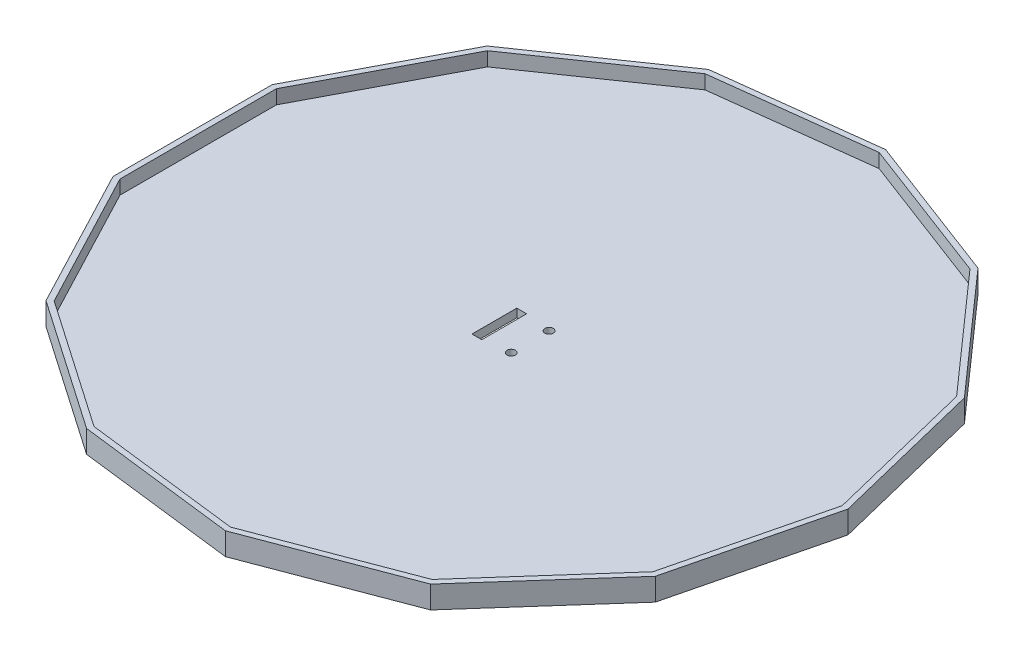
ISO-10303-21;
HEADER;
FILE_DESCRIPTION(('STEP AP214'),'2;1');
FILE_NAME('part.step','',(''),(''),'','','');
FILE_SCHEMA(('AUTOMOTIVE_DESIGN { 1 0 10303 214 1 1 1 1 }'));
ENDSEC;
DATA;
#1=APPLICATION_CONTEXT('core data for automotive mechanical design processes');
#2=APPLICATION_PROTOCOL_DEFINITION('international standard','automotive_design',2000,#1);
#3=PRODUCT_CONTEXT('',#1,'mechanical');
#4=PRODUCT('Part','Part','',(#3));
#5=PRODUCT_RELATED_PRODUCT_CATEGORY('part','',(#4));
#6=PRODUCT_DEFINITION_FORMATION('','',#4);
#7=PRODUCT_DEFINITION_CONTEXT('part definition',#1,'design');
#8=PRODUCT_DEFINITION('design','',#6,#7);
#9=PRODUCT_DEFINITION_SHAPE('','',#8);
#10=(LENGTH_UNIT() NAMED_UNIT(*) SI_UNIT(.MILLI.,.METRE.));
#11=(NAMED_UNIT(*) PLANE_ANGLE_UNIT() SI_UNIT($,.RADIAN.));
#12=(NAMED_UNIT(*) SI_UNIT($,.STERADIAN.) SOLID_ANGLE_UNIT());
#13=UNCERTAINTY_MEASURE_WITH_UNIT(LENGTH_MEASURE(1.E-05),#10,'distance_accuracy_value','');
#14=(GEOMETRIC_REPRESENTATION_CONTEXT(3) GLOBAL_UNCERTAINTY_ASSIGNED_CONTEXT((#13)) GLOBAL_UNIT_ASSIGNED_CONTEXT((#10,
#11,#12)) REPRESENTATION_CONTEXT('',''));
#15=CARTESIAN_POINT('',(0.,0.,0.));
#16=DIRECTION('',(0.,0.,1.));
#17=DIRECTION('',(1.,0.,0.));
#18=AXIS2_PLACEMENT_3D('',#15,#16,#17);
#19=CARTESIAN_POINT('',(0.,8.,0.));
#20=DIRECTION('',(0.,1.,0.));
#21=DIRECTION('',(0.,0.,1.));
#22=AXIS2_PLACEMENT_3D('',#19,#20,#21);
#23=PLANE('',#22);
#24=DIRECTION('',(-0.822983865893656,0.,0.568064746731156));
#25=VECTOR('',#24,1.);
#26=CARTESIAN_POINT('',(-42.0528725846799,8.,-110.884311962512));
#27=LINE('',#26,#25);
#28=CARTESIAN_POINT('',(-42.0528725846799,8.,-110.884311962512));
#29=VERTEX_POINT('',#28);
#30=CARTESIAN_POINT('',(-88.7664786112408,8.,-78.6402378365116));
#31=VERTEX_POINT('',#30);
#32=EDGE_CURVE('E422',#29,#31,#27,.T.);
#33=ORIENTED_EDGE('',*,*,#32,.T.);
#34=DIRECTION('',(-0.464723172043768,0.,0.88545602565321));
#35=VECTOR('',#34,1.);
#36=CARTESIAN_POINT('',(-88.7664786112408,8.,-78.6402378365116));
#37=LINE('',#36,#35);
#38=CARTESIAN_POINT('',(-115.14475414,8.,-28.3806329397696));
#39=VERTEX_POINT('',#38);
#40=EDGE_CURVE('E426',#31,#39,#37,.T.);
#41=ORIENTED_EDGE('',*,*,#40,.T.);
#42=DIRECTION('',(0.,0.,1.));
#43=VECTOR('',#42,1.);
#44=CARTESIAN_POINT('',(-115.14475414,8.,-28.3806329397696));
#45=LINE('',#44,#43);
#46=CARTESIAN_POINT('',(-115.14475414,8.,28.3806329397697));
#47=VERTEX_POINT('',#46);
#48=EDGE_CURVE('E430',#39,#47,#45,.T.);
#49=ORIENTED_EDGE('',*,*,#48,.T.);
#50=DIRECTION('',(0.464723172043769,0.,0.88545602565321));
#51=VECTOR('',#50,1.);
#52=CARTESIAN_POINT('',(-115.14475414,8.,28.3806329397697));
#53=LINE('',#52,#51);
#54=CARTESIAN_POINT('',(-88.7664786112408,8.,78.6402378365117));
#55=VERTEX_POINT('',#54);
#56=EDGE_CURVE('E433',#47,#55,#53,.T.);
#57=ORIENTED_EDGE('',*,*,#56,.T.);
#58=DIRECTION('',(0.822983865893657,0.,0.568064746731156));
#59=VECTOR('',#58,1.);
#60=CARTESIAN_POINT('',(-88.7664786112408,8.,78.6402378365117));
#61=LINE('',#60,#59);
#62=CARTESIAN_POINT('',(-42.0528725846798,8.,110.884311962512));
#63=VERTEX_POINT('',#62);
#64=EDGE_CURVE('E436',#55,#63,#61,.T.);
#65=ORIENTED_EDGE('',*,*,#64,.T.);
#66=DIRECTION('',(0.992708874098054,0.,0.120536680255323));
#67=VECTOR('',#66,1.);
#68=CARTESIAN_POINT('',(-42.0528725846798,8.,110.884311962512));
#69=LINE('',#68,#67);
#70=CARTESIAN_POINT('',(14.2945397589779,8.,117.726126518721));
#71=VERTEX_POINT('',#70);
#72=EDGE_CURVE('E439',#63,#71,#69,.T.);
#73=ORIENTED_EDGE('',*,*,#72,.T.);
#74=DIRECTION('',(0.935016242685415,0.,-0.354604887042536));
#75=VECTOR('',#74,1.);
#76=CARTESIAN_POINT('',(14.2945397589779,8.,117.726126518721));
#77=LINE('',#76,#75);
#78=CARTESIAN_POINT('',(67.3672453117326,8.,97.598304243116));
#79=VERTEX_POINT('',#78);
#80=EDGE_CURVE('E442',#71,#79,#77,.T.);
#81=ORIENTED_EDGE('',*,*,#80,.T.);
#82=DIRECTION('',(0.663122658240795,0.,-0.748510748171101));
#83=VECTOR('',#82,1.);
#84=CARTESIAN_POINT('',(67.3672453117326,8.,97.598304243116));
#85=LINE('',#84,#83);
#86=CARTESIAN_POINT('',(105.006926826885,8.,55.1118866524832));
#87=VERTEX_POINT('',#86);
#88=EDGE_CURVE('E445',#79,#87,#85,.T.);
#89=ORIENTED_EDGE('',*,*,#88,.T.);
#90=DIRECTION('',(0.239315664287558,0.,-0.970941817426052));
#91=VECTOR('',#90,1.);
#92=CARTESIAN_POINT('',(105.006926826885,8.,55.1118866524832));
#93=LINE('',#92,#91);
#94=CARTESIAN_POINT('',(118.59078687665,8.,0.));
#95=VERTEX_POINT('',#94);
#96=EDGE_CURVE('E448',#87,#95,#93,.T.);
#97=ORIENTED_EDGE('',*,*,#96,.T.);
#98=DIRECTION('',(-0.239315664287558,0.,-0.970941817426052));
#99=VECTOR('',#98,1.);
#100=CARTESIAN_POINT('',(118.59078687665,8.,0.));
#101=LINE('',#100,#99);
#102=CARTESIAN_POINT('',(105.006926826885,8.,-55.1118866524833));
#103=VERTEX_POINT('',#102);
#104=EDGE_CURVE('E451',#95,#103,#101,.T.);
#105=ORIENTED_EDGE('',*,*,#104,.T.);
#106=DIRECTION('',(-0.663122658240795,0.,-0.748510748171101));
#107=VECTOR('',#106,1.);
#108=CARTESIAN_POINT('',(105.006926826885,8.,-55.1118866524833));
#109=LINE('',#108,#107);
#110=CARTESIAN_POINT('',(67.3672453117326,8.,-97.598304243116));
#111=VERTEX_POINT('',#110);
#112=EDGE_CURVE('E454',#103,#111,#109,.T.);
#113=ORIENTED_EDGE('',*,*,#112,.T.);
#114=DIRECTION('',(-0.935016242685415,0.,-0.354604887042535));
#115=VECTOR('',#114,1.);
#116=CARTESIAN_POINT('',(67.3672453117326,8.,-97.598304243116));
#117=LINE('',#116,#115);
#118=CARTESIAN_POINT('',(14.2945397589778,8.,-117.726126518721));
#119=VERTEX_POINT('',#118);
#120=EDGE_CURVE('E457',#111,#119,#117,.T.);
#121=ORIENTED_EDGE('',*,*,#120,.T.);
#122=DIRECTION('',(-0.992708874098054,0.,0.120536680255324));
#123=VECTOR('',#122,1.);
#124=CARTESIAN_POINT('',(14.2945397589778,8.,-117.726126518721));
#125=LINE('',#124,#123);
#126=EDGE_CURVE('E460',#119,#29,#125,.T.);
#127=ORIENTED_EDGE('',*,*,#126,.T.);
#128=EDGE_LOOP('',(#33,#41,#49,#57,#65,#73,#81,#89,#97,#105,#113,#121,#127));
#129=FACE_BOUND('',#128,.T.);
#130=DIRECTION('',(-0.239315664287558,0.,-0.970941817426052));
#131=VECTOR('',#130,1.);
#132=CARTESIAN_POINT('',(116.53093121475,8.,0.));
#133=LINE('',#132,#131);
#134=CARTESIAN_POINT('',(116.53093121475,8.,0.));
#135=VERTEX_POINT('',#134);
#136=CARTESIAN_POINT('',(103.18301521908,8.,-54.154623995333));
#137=VERTEX_POINT('',#136);
#138=EDGE_CURVE('E333',#135,#137,#133,.T.);
#139=ORIENTED_EDGE('',*,*,#138,.F.);
#140=DIRECTION('',(0.239315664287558,0.,-0.970941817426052));
#141=VECTOR('',#140,1.);
#142=CARTESIAN_POINT('',(103.183015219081,8.,54.154623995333));
#143=LINE('',#142,#141);
#144=CARTESIAN_POINT('',(103.183015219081,8.,54.154623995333));
#145=VERTEX_POINT('',#144);
#146=EDGE_CURVE('E330',#145,#135,#143,.T.);
#147=ORIENTED_EDGE('',*,*,#146,.F.);
#148=DIRECTION('',(0.663122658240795,0.,-0.748510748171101));
#149=VECTOR('',#148,1.);
#150=CARTESIAN_POINT('',(66.197113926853,8.,95.903076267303));
#151=LINE('',#150,#149);
#152=CARTESIAN_POINT('',(66.1971139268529,8.,95.903076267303));
#153=VERTEX_POINT('',#152);
#154=EDGE_CURVE('E367',#153,#145,#151,.T.);
#155=ORIENTED_EDGE('',*,*,#154,.F.);
#156=DIRECTION('',(0.935016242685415,0.,-0.354604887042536));
#157=VECTOR('',#156,1.);
#158=CARTESIAN_POINT('',(14.0462515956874,8.,115.681289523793));
#159=LINE('',#158,#157);
#160=CARTESIAN_POINT('',(14.0462515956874,8.,115.681289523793));
#161=VERTEX_POINT('',#160);
#162=EDGE_CURVE('E363',#161,#153,#159,.T.);
#163=ORIENTED_EDGE('',*,*,#162,.F.);
#164=DIRECTION('',(0.992708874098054,0.,0.120536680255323));
#165=VECTOR('',#164,1.);
#166=CARTESIAN_POINT('',(-41.322437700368,8.,108.958313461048));
#167=LINE('',#166,#165);
#168=CARTESIAN_POINT('',(-41.322437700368,8.,108.958313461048));
#169=VERTEX_POINT('',#168);
#170=EDGE_CURVE('E360',#169,#161,#167,.T.);
#171=ORIENTED_EDGE('',*,*,#170,.F.);
#172=DIRECTION('',(0.822983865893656,0.,0.568064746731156));
#173=VECTOR('',#172,1.);
#174=CARTESIAN_POINT('',(-87.224654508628,8.,77.2743008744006));
#175=LINE('',#174,#173);
#176=CARTESIAN_POINT('',(-87.224654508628,8.,77.2743008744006));
#177=VERTEX_POINT('',#176);
#178=EDGE_CURVE('E357',#177,#169,#175,.T.);
#179=ORIENTED_EDGE('',*,*,#178,.F.);
#180=DIRECTION('',(0.464723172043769,0.,0.88545602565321));
#181=VECTOR('',#180,1.);
#182=CARTESIAN_POINT('',(-113.14475414,8.,27.8876772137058));
#183=LINE('',#182,#181);
#184=CARTESIAN_POINT('',(-113.14475414,8.,27.8876772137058));
#185=VERTEX_POINT('',#184);
#186=EDGE_CURVE('E354',#185,#177,#183,.T.);
#187=ORIENTED_EDGE('',*,*,#186,.F.);
#188=DIRECTION('',(0.,0.,1.));
#189=VECTOR('',#188,1.);
#190=CARTESIAN_POINT('',(-113.14475414,8.,-27.8876772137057));
#191=LINE('',#190,#189);
#192=CARTESIAN_POINT('',(-113.14475414,8.,-27.8876772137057));
#193=VERTEX_POINT('',#192);
#194=EDGE_CURVE('E351',#193,#185,#191,.T.);
#195=ORIENTED_EDGE('',*,*,#194,.F.);
#196=DIRECTION('',(-0.464723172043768,0.,0.88545602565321));
#197=VECTOR('',#196,1.);
#198=CARTESIAN_POINT('',(-87.224654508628,8.,-77.2743008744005));
#199=LINE('',#198,#197);
#200=CARTESIAN_POINT('',(-87.224654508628,8.,-77.2743008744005));
#201=VERTEX_POINT('',#200);
#202=EDGE_CURVE('E348',#201,#193,#199,.T.);
#203=ORIENTED_EDGE('',*,*,#202,.F.);
#204=DIRECTION('',(-0.822983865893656,0.,0.568064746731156));
#205=VECTOR('',#204,1.);
#206=CARTESIAN_POINT('',(-41.3224377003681,8.,-108.958313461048));
#207=LINE('',#206,#205);
#208=CARTESIAN_POINT('',(-41.3224377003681,8.,-108.958313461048));
#209=VERTEX_POINT('',#208);
#210=EDGE_CURVE('E345',#209,#201,#207,.T.);
#211=ORIENTED_EDGE('',*,*,#210,.F.);
#212=DIRECTION('',(-0.992708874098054,0.,0.120536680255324));
#213=VECTOR('',#212,1.);
#214=CARTESIAN_POINT('',(14.0462515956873,8.,-115.681289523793));
#215=LINE('',#214,#213);
#216=CARTESIAN_POINT('',(14.0462515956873,8.,-115.681289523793));
#217=VERTEX_POINT('',#216);
#218=EDGE_CURVE('E342',#217,#209,#215,.T.);
#219=ORIENTED_EDGE('',*,*,#218,.F.);
#220=DIRECTION('',(-0.935016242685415,0.,-0.354604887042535));
#221=VECTOR('',#220,1.);
#222=CARTESIAN_POINT('',(66.1971139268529,8.,-95.9030762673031));
#223=LINE('',#222,#221);
#224=CARTESIAN_POINT('',(66.1971139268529,8.,-95.9030762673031));
#225=VERTEX_POINT('',#224);
#226=EDGE_CURVE('E339',#225,#217,#223,.T.);
#227=ORIENTED_EDGE('',*,*,#226,.F.);
#228=DIRECTION('',(-0.663122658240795,0.,-0.748510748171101));
#229=VECTOR('',#228,1.);
#230=CARTESIAN_POINT('',(103.18301521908,8.,-54.154623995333));
#231=LINE('',#230,#229);
#232=EDGE_CURVE('E336',#137,#225,#231,.T.);
#233=ORIENTED_EDGE('',*,*,#232,.F.);
#234=EDGE_LOOP('',(#139,#147,#155,#163,#171,#179,#187,#195,#203,#211,#219,#227,#233));
#235=FACE_BOUND('',#234,.T.);
#236=ADVANCED_FACE('F39',(#129,#235),#23,.T.);
#237=CARTESIAN_POINT('',(0.,0.,0.));
#238=DIRECTION('',(0.,1.,0.));
#239=DIRECTION('',(0.,0.,1.));
#240=AXIS2_PLACEMENT_3D('',#237,#238,#239);
#241=PLANE('',#240);
#242=CARTESIAN_POINT('',(5.25,0.,6.75));
#243=DIRECTION('',(0.,1.,0.));
#244=DIRECTION('',(0.,0.,-1.));
#245=AXIS2_PLACEMENT_3D('',#242,#243,#244);
#246=CIRCLE('',#245,1.5);
#247=CARTESIAN_POINT('',(5.25,0.,5.25));
#248=VERTEX_POINT('',#247);
#249=EDGE_CURVE('E261',#248,#248,#246,.T.);
#250=ORIENTED_EDGE('',*,*,#249,.T.);
#251=EDGE_LOOP('',(#250));
#252=FACE_BOUND('',#251,.T.);
#253=DIRECTION('',(0.,0.,-1.));
#254=VECTOR('',#253,1.);
#255=CARTESIAN_POINT('',(-4.,0.,8.));
#256=LINE('',#255,#254);
#257=CARTESIAN_POINT('',(-4.,0.,8.));
#258=VERTEX_POINT('',#257);
#259=CARTESIAN_POINT('',(-4.,0.,-8.));
#260=VERTEX_POINT('',#259);
#261=EDGE_CURVE('E56',#258,#260,#256,.T.);
#262=ORIENTED_EDGE('',*,*,#261,.T.);
#263=DIRECTION('',(-1.,0.,0.));
#264=VECTOR('',#263,1.);
#265=CARTESIAN_POINT('',(-7.5,0.,-8.));
#266=LINE('',#265,#264);
#267=CARTESIAN_POINT('',(-7.5,0.,-8.));
#268=VERTEX_POINT('',#267);
#269=EDGE_CURVE('E247',#260,#268,#266,.T.);
#270=ORIENTED_EDGE('',*,*,#269,.T.);
#271=DIRECTION('',(0.,0.,1.));
#272=VECTOR('',#271,1.);
#273=CARTESIAN_POINT('',(-7.5,0.,8.));
#274=LINE('',#273,#272);
#275=CARTESIAN_POINT('',(-7.5,0.,8.));
#276=VERTEX_POINT('',#275);
#277=EDGE_CURVE('E254',#268,#276,#274,.T.);
#278=ORIENTED_EDGE('',*,*,#277,.T.);
#279=DIRECTION('',(1.,0.,0.));
#280=VECTOR('',#279,1.);
#281=CARTESIAN_POINT('',(-7.5,0.,8.));
#282=LINE('',#281,#280);
#283=EDGE_CURVE('E259',#276,#258,#282,.T.);
#284=ORIENTED_EDGE('',*,*,#283,.T.);
#285=EDGE_LOOP('',(#262,#270,#278,#284));
#286=FACE_BOUND('',#285,.T.);
#287=CARTESIAN_POINT('',(5.25,0.,-6.75));
#288=DIRECTION('',(0.,1.,0.));
#289=DIRECTION('',(0.,0.,1.));
#290=AXIS2_PLACEMENT_3D('',#287,#288,#289);
#291=CIRCLE('',#290,1.5);
#292=CARTESIAN_POINT('',(5.25,0.,-5.25));
#293=VERTEX_POINT('',#292);
#294=EDGE_CURVE('E243',#293,#293,#291,.T.);
#295=ORIENTED_EDGE('',*,*,#294,.T.);
#296=EDGE_LOOP('',(#295));
#297=FACE_BOUND('',#296,.T.);
#298=DIRECTION('',(-0.822983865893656,0.,0.568064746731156));
#299=VECTOR('',#298,1.);
#300=CARTESIAN_POINT('',(-42.0528725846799,0.,-110.884311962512));
#301=LINE('',#300,#299);
#302=CARTESIAN_POINT('',(-42.0528725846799,0.,-110.884311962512));
#303=VERTEX_POINT('',#302);
#304=CARTESIAN_POINT('',(-88.7664786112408,0.,-78.6402378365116));
#305=VERTEX_POINT('',#304);
#306=EDGE_CURVE('E421',#303,#305,#301,.T.);
#307=ORIENTED_EDGE('',*,*,#306,.F.);
#308=DIRECTION('',(-0.992708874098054,0.,0.120536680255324));
#309=VECTOR('',#308,1.);
#310=CARTESIAN_POINT('',(14.2945397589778,0.,-117.726126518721));
#311=LINE('',#310,#309);
#312=CARTESIAN_POINT('',(14.2945397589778,0.,-117.726126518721));
#313=VERTEX_POINT('',#312);
#314=EDGE_CURVE('E427',#313,#303,#311,.T.);
#315=ORIENTED_EDGE('',*,*,#314,.F.);
#316=DIRECTION('',(-0.935016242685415,0.,-0.354604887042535));
#317=VECTOR('',#316,1.);
#318=CARTESIAN_POINT('',(67.3672453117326,0.,-97.598304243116));
#319=LINE('',#318,#317);
#320=CARTESIAN_POINT('',(67.3672453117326,0.,-97.598304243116));
#321=VERTEX_POINT('',#320);
#322=EDGE_CURVE('E507',#321,#313,#319,.T.);
#323=ORIENTED_EDGE('',*,*,#322,.F.);
#324=DIRECTION('',(-0.663122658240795,0.,-0.748510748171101));
#325=VECTOR('',#324,1.);
#326=CARTESIAN_POINT('',(105.006926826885,0.,-55.1118866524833));
#327=LINE('',#326,#325);
#328=CARTESIAN_POINT('',(105.006926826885,0.,-55.1118866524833));
#329=VERTEX_POINT('',#328);
#330=EDGE_CURVE('E503',#329,#321,#327,.T.);
#331=ORIENTED_EDGE('',*,*,#330,.F.);
#332=DIRECTION('',(-0.239315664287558,0.,-0.970941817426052));
#333=VECTOR('',#332,1.);
#334=CARTESIAN_POINT('',(118.59078687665,0.,0.));
#335=LINE('',#334,#333);
#336=CARTESIAN_POINT('',(118.59078687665,0.,0.));
#337=VERTEX_POINT('',#336);
#338=EDGE_CURVE('E499',#337,#329,#335,.T.);
#339=ORIENTED_EDGE('',*,*,#338,.F.);
#340=DIRECTION('',(0.239315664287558,0.,-0.970941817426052));
#341=VECTOR('',#340,1.);
#342=CARTESIAN_POINT('',(105.006926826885,0.,55.1118866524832));
#343=LINE('',#342,#341);
#344=CARTESIAN_POINT('',(105.006926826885,0.,55.1118866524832));
#345=VERTEX_POINT('',#344);
#346=EDGE_CURVE('E495',#345,#337,#343,.T.);
#347=ORIENTED_EDGE('',*,*,#346,.F.);
#348=DIRECTION('',(0.663122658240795,0.,-0.748510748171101));
#349=VECTOR('',#348,1.);
#350=CARTESIAN_POINT('',(67.3672453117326,0.,97.598304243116));
#351=LINE('',#350,#349);
#352=CARTESIAN_POINT('',(67.3672453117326,0.,97.598304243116));
#353=VERTEX_POINT('',#352);
#354=EDGE_CURVE('E491',#353,#345,#351,.T.);
#355=ORIENTED_EDGE('',*,*,#354,.F.);
#356=DIRECTION('',(0.935016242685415,0.,-0.354604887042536));
#357=VECTOR('',#356,1.);
#358=CARTESIAN_POINT('',(14.2945397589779,0.,117.726126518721));
#359=LINE('',#358,#357);
#360=CARTESIAN_POINT('',(14.2945397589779,0.,117.726126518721));
#361=VERTEX_POINT('',#360);
#362=EDGE_CURVE('E487',#361,#353,#359,.T.);
#363=ORIENTED_EDGE('',*,*,#362,.F.);
#364=DIRECTION('',(0.992708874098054,0.,0.120536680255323));
#365=VECTOR('',#364,1.);
#366=CARTESIAN_POINT('',(-42.0528725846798,0.,110.884311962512));
#367=LINE('',#366,#365);
#368=CARTESIAN_POINT('',(-42.0528725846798,0.,110.884311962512));
#369=VERTEX_POINT('',#368);
#370=EDGE_CURVE('E483',#369,#361,#367,.T.);
#371=ORIENTED_EDGE('',*,*,#370,.F.);
#372=DIRECTION('',(0.822983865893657,0.,0.568064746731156));
#373=VECTOR('',#372,1.);
#374=CARTESIAN_POINT('',(-88.7664786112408,0.,78.6402378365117));
#375=LINE('',#374,#373);
#376=CARTESIAN_POINT('',(-88.7664786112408,0.,78.6402378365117));
#377=VERTEX_POINT('',#376);
#378=EDGE_CURVE('E479',#377,#369,#375,.T.);
#379=ORIENTED_EDGE('',*,*,#378,.F.);
#380=DIRECTION('',(0.464723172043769,0.,0.88545602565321));
#381=VECTOR('',#380,1.);
#382=CARTESIAN_POINT('',(-115.14475414,0.,28.3806329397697));
#383=LINE('',#382,#381);
#384=CARTESIAN_POINT('',(-115.14475414,0.,28.3806329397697));
#385=VERTEX_POINT('',#384);
#386=EDGE_CURVE('E475',#385,#377,#383,.T.);
#387=ORIENTED_EDGE('',*,*,#386,.F.);
#388=DIRECTION('',(0.,0.,1.));
#389=VECTOR('',#388,1.);
#390=CARTESIAN_POINT('',(-115.14475414,0.,-28.3806329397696));
#391=LINE('',#390,#389);
#392=CARTESIAN_POINT('',(-115.14475414,0.,-28.3806329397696));
#393=VERTEX_POINT('',#392);
#394=EDGE_CURVE('E471',#393,#385,#391,.T.);
#395=ORIENTED_EDGE('',*,*,#394,.F.);
#396=DIRECTION('',(-0.464723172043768,0.,0.88545602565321));
#397=VECTOR('',#396,1.);
#398=CARTESIAN_POINT('',(-88.7664786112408,0.,-78.6402378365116));
#399=LINE('',#398,#397);
#400=EDGE_CURVE('E467',#305,#393,#399,.T.);
#401=ORIENTED_EDGE('',*,*,#400,.F.);
#402=EDGE_LOOP('',(#307,#315,#323,#331,#339,#347,#355,#363,#371,#379,#387,#395,#401));
#403=FACE_BOUND('',#402,.T.);
#404=ADVANCED_FACE('F257',(#252,#286,#297,#403),#241,.F.);
#405=CARTESIAN_POINT('',(-42.0528725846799,8.,-110.884311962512));
#406=DIRECTION('',(0.568064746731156,0.,0.822983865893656));
#407=DIRECTION('',(0.822983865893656,0.,-0.568064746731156));
#408=AXIS2_PLACEMENT_3D('',#405,#406,#407);
#409=PLANE('',#408);
#410=DIRECTION('',(0.,-1.,0.));
#411=VECTOR('',#410,1.);
#412=CARTESIAN_POINT('',(-42.0528725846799,8.,-110.884311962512));
#413=LINE('',#412,#411);
#414=EDGE_CURVE('E463',#29,#303,#413,.T.);
#415=ORIENTED_EDGE('',*,*,#414,.T.);
#416=ORIENTED_EDGE('',*,*,#306,.T.);
#417=DIRECTION('',(0.,-1.,0.));
#418=VECTOR('',#417,1.);
#419=CARTESIAN_POINT('',(-88.7664786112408,8.,-78.6402378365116));
#420=LINE('',#419,#418);
#421=EDGE_CURVE('E549',#31,#305,#420,.T.);
#422=ORIENTED_EDGE('',*,*,#421,.F.);
#423=ORIENTED_EDGE('',*,*,#32,.F.);
#424=EDGE_LOOP('',(#415,#416,#422,#423));
#425=FACE_BOUND('',#424,.T.);
#426=ADVANCED_FACE('F41',(#425),#409,.F.);
#427=CARTESIAN_POINT('',(-88.7664786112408,8.,-78.6402378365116));
#428=DIRECTION('',(0.88545602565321,0.,0.464723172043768));
#429=DIRECTION('',(0.464723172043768,0.,-0.88545602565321));
#430=AXIS2_PLACEMENT_3D('',#427,#428,#429);
#431=PLANE('',#430);
#432=ORIENTED_EDGE('',*,*,#421,.T.);
#433=ORIENTED_EDGE('',*,*,#400,.T.);
#434=DIRECTION('',(0.,-1.,0.));
#435=VECTOR('',#434,1.);
#436=CARTESIAN_POINT('',(-115.14475414,8.,-28.3806329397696));
#437=LINE('',#436,#435);
#438=EDGE_CURVE('E546',#39,#393,#437,.T.);
#439=ORIENTED_EDGE('',*,*,#438,.F.);
#440=ORIENTED_EDGE('',*,*,#40,.F.);
#441=EDGE_LOOP('',(#432,#433,#439,#440));
#442=FACE_BOUND('',#441,.T.);
#443=ADVANCED_FACE('F639',(#442),#431,.F.);
#444=CARTESIAN_POINT('',(-115.14475414,8.,-28.3806329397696));
#445=DIRECTION('',(1.,0.,0.));
#446=DIRECTION('',(0.,0.,-1.));
#447=AXIS2_PLACEMENT_3D('',#444,#445,#446);
#448=PLANE('',#447);
#449=ORIENTED_EDGE('',*,*,#438,.T.);
#450=ORIENTED_EDGE('',*,*,#394,.T.);
#451=DIRECTION('',(0.,-1.,0.));
#452=VECTOR('',#451,1.);
#453=CARTESIAN_POINT('',(-115.14475414,8.,28.3806329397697));
#454=LINE('',#453,#452);
#455=EDGE_CURVE('E543',#47,#385,#454,.T.);
#456=ORIENTED_EDGE('',*,*,#455,.F.);
#457=ORIENTED_EDGE('',*,*,#48,.F.);
#458=EDGE_LOOP('',(#449,#450,#456,#457));
#459=FACE_BOUND('',#458,.T.);
#460=ADVANCED_FACE('F636',(#459),#448,.F.);
#461=CARTESIAN_POINT('',(-115.14475414,8.,28.3806329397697));
#462=DIRECTION('',(0.88545602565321,0.,-0.464723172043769));
#463=DIRECTION('',(-0.464723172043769,0.,-0.88545602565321));
#464=AXIS2_PLACEMENT_3D('',#461,#462,#463);
#465=PLANE('',#464);
#466=ORIENTED_EDGE('',*,*,#455,.T.);
#467=ORIENTED_EDGE('',*,*,#386,.T.);
#468=DIRECTION('',(0.,-1.,0.));
#469=VECTOR('',#468,1.);
#470=CARTESIAN_POINT('',(-88.7664786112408,8.,78.6402378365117));
#471=LINE('',#470,#469);
#472=EDGE_CURVE('E540',#55,#377,#471,.T.);
#473=ORIENTED_EDGE('',*,*,#472,.F.);
#474=ORIENTED_EDGE('',*,*,#56,.F.);
#475=EDGE_LOOP('',(#466,#467,#473,#474));
#476=FACE_BOUND('',#475,.T.);
#477=ADVANCED_FACE('F632',(#476),#465,.F.);
#478=CARTESIAN_POINT('',(-88.7664786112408,8.,78.6402378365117));
#479=DIRECTION('',(0.568064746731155,0.,-0.822983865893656));
#480=DIRECTION('',(-0.822983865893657,0.,-0.568064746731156));
#481=AXIS2_PLACEMENT_3D('',#478,#479,#480);
#482=PLANE('',#481);
#483=ORIENTED_EDGE('',*,*,#472,.T.);
#484=ORIENTED_EDGE('',*,*,#378,.T.);
#485=DIRECTION('',(0.,-1.,0.));
#486=VECTOR('',#485,1.);
#487=CARTESIAN_POINT('',(-42.0528725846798,8.,110.884311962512));
#488=LINE('',#487,#486);
#489=EDGE_CURVE('E537',#63,#369,#488,.T.);
#490=ORIENTED_EDGE('',*,*,#489,.F.);
#491=ORIENTED_EDGE('',*,*,#64,.F.);
#492=EDGE_LOOP('',(#483,#484,#490,#491));
#493=FACE_BOUND('',#492,.T.);
#494=ADVANCED_FACE('F628',(#493),#482,.F.);
#495=CARTESIAN_POINT('',(-42.0528725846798,8.,110.884311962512));
#496=DIRECTION('',(0.120536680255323,0.,-0.992708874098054));
#497=DIRECTION('',(-0.992708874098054,0.,-0.120536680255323));
#498=AXIS2_PLACEMENT_3D('',#495,#496,#497);
#499=PLANE('',#498);
#500=ORIENTED_EDGE('',*,*,#489,.T.);
#501=ORIENTED_EDGE('',*,*,#370,.T.);
#502=DIRECTION('',(0.,-1.,0.));
#503=VECTOR('',#502,1.);
#504=CARTESIAN_POINT('',(14.2945397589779,8.,117.726126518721));
#505=LINE('',#504,#503);
#506=EDGE_CURVE('E534',#71,#361,#505,.T.);
#507=ORIENTED_EDGE('',*,*,#506,.F.);
#508=ORIENTED_EDGE('',*,*,#72,.F.);
#509=EDGE_LOOP('',(#500,#501,#507,#508));
#510=FACE_BOUND('',#509,.T.);
#511=ADVANCED_FACE('F624',(#510),#499,.F.);
#512=CARTESIAN_POINT('',(14.2945397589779,8.,117.726126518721));
#513=DIRECTION('',(-0.354604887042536,0.,-0.935016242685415));
#514=DIRECTION('',(-0.935016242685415,0.,0.354604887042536));
#515=AXIS2_PLACEMENT_3D('',#512,#513,#514);
#516=PLANE('',#515);
#517=ORIENTED_EDGE('',*,*,#506,.T.);
#518=ORIENTED_EDGE('',*,*,#362,.T.);
#519=DIRECTION('',(0.,-1.,0.));
#520=VECTOR('',#519,1.);
#521=CARTESIAN_POINT('',(67.3672453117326,8.,97.598304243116));
#522=LINE('',#521,#520);
#523=EDGE_CURVE('E531',#79,#353,#522,.T.);
#524=ORIENTED_EDGE('',*,*,#523,.F.);
#525=ORIENTED_EDGE('',*,*,#80,.F.);
#526=EDGE_LOOP('',(#517,#518,#524,#525));
#527=FACE_BOUND('',#526,.T.);
#528=ADVANCED_FACE('F620',(#527),#516,.F.);
#529=CARTESIAN_POINT('',(67.3672453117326,8.,97.598304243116));
#530=DIRECTION('',(-0.748510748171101,0.,-0.663122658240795));
#531=DIRECTION('',(-0.663122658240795,0.,0.748510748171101));
#532=AXIS2_PLACEMENT_3D('',#529,#530,#531);
#533=PLANE('',#532);
#534=ORIENTED_EDGE('',*,*,#523,.T.);
#535=ORIENTED_EDGE('',*,*,#354,.T.);
#536=DIRECTION('',(0.,-1.,0.));
#537=VECTOR('',#536,1.);
#538=CARTESIAN_POINT('',(105.006926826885,8.,55.1118866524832));
#539=LINE('',#538,#537);
#540=EDGE_CURVE('E528',#87,#345,#539,.T.);
#541=ORIENTED_EDGE('',*,*,#540,.F.);
#542=ORIENTED_EDGE('',*,*,#88,.F.);
#543=EDGE_LOOP('',(#534,#535,#541,#542));
#544=FACE_BOUND('',#543,.T.);
#545=ADVANCED_FACE('F616',(#544),#533,.F.);
#546=CARTESIAN_POINT('',(105.006926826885,8.,55.1118866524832));
#547=DIRECTION('',(-0.970941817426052,0.,-0.239315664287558));
#548=DIRECTION('',(-0.239315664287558,0.,0.970941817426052));
#549=AXIS2_PLACEMENT_3D('',#546,#547,#548);
#550=PLANE('',#549);
#551=ORIENTED_EDGE('',*,*,#540,.T.);
#552=ORIENTED_EDGE('',*,*,#346,.T.);
#553=DIRECTION('',(0.,-1.,0.));
#554=VECTOR('',#553,1.);
#555=CARTESIAN_POINT('',(118.59078687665,8.,0.));
#556=LINE('',#555,#554);
#557=EDGE_CURVE('E525',#95,#337,#556,.T.);
#558=ORIENTED_EDGE('',*,*,#557,.F.);
#559=ORIENTED_EDGE('',*,*,#96,.F.);
#560=EDGE_LOOP('',(#551,#552,#558,#559));
#561=FACE_BOUND('',#560,.T.);
#562=ADVANCED_FACE('F612',(#561),#550,.F.);
#563=CARTESIAN_POINT('',(118.59078687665,8.,0.));
#564=DIRECTION('',(-0.970941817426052,0.,0.239315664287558));
#565=DIRECTION('',(0.239315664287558,0.,0.970941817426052));
#566=AXIS2_PLACEMENT_3D('',#563,#564,#565);
#567=PLANE('',#566);
#568=ORIENTED_EDGE('',*,*,#557,.T.);
#569=ORIENTED_EDGE('',*,*,#338,.T.);
#570=DIRECTION('',(0.,-1.,0.));
#571=VECTOR('',#570,1.);
#572=CARTESIAN_POINT('',(105.006926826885,8.,-55.1118866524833));
#573=LINE('',#572,#571);
#574=EDGE_CURVE('E522',#103,#329,#573,.T.);
#575=ORIENTED_EDGE('',*,*,#574,.F.);
#576=ORIENTED_EDGE('',*,*,#104,.F.);
#577=EDGE_LOOP('',(#568,#569,#575,#576));
#578=FACE_BOUND('',#577,.T.);
#579=ADVANCED_FACE('F608',(#578),#567,.F.);
#580=CARTESIAN_POINT('',(105.006926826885,8.,-55.1118866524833));
#581=DIRECTION('',(-0.748510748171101,0.,0.663122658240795));
#582=DIRECTION('',(0.663122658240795,0.,0.748510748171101));
#583=AXIS2_PLACEMENT_3D('',#580,#581,#582);
#584=PLANE('',#583);
#585=ORIENTED_EDGE('',*,*,#574,.T.);
#586=ORIENTED_EDGE('',*,*,#330,.T.);
#587=DIRECTION('',(0.,-1.,0.));
#588=VECTOR('',#587,1.);
#589=CARTESIAN_POINT('',(67.3672453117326,8.,-97.598304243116));
#590=LINE('',#589,#588);
#591=EDGE_CURVE('E519',#111,#321,#590,.T.);
#592=ORIENTED_EDGE('',*,*,#591,.F.);
#593=ORIENTED_EDGE('',*,*,#112,.F.);
#594=EDGE_LOOP('',(#585,#586,#592,#593));
#595=FACE_BOUND('',#594,.T.);
#596=ADVANCED_FACE('F604',(#595),#584,.F.);
#597=CARTESIAN_POINT('',(67.3672453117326,8.,-97.598304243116));
#598=DIRECTION('',(-0.354604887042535,0.,0.935016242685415));
#599=DIRECTION('',(0.935016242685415,0.,0.354604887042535));
#600=AXIS2_PLACEMENT_3D('',#597,#598,#599);
#601=PLANE('',#600);
#602=ORIENTED_EDGE('',*,*,#591,.T.);
#603=ORIENTED_EDGE('',*,*,#322,.T.);
#604=DIRECTION('',(0.,-1.,0.));
#605=VECTOR('',#604,1.);
#606=CARTESIAN_POINT('',(14.2945397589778,8.,-117.726126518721));
#607=LINE('',#606,#605);
#608=EDGE_CURVE('E516',#119,#313,#607,.T.);
#609=ORIENTED_EDGE('',*,*,#608,.F.);
#610=ORIENTED_EDGE('',*,*,#120,.F.);
#611=EDGE_LOOP('',(#602,#603,#609,#610));
#612=FACE_BOUND('',#611,.T.);
#613=ADVANCED_FACE('F600',(#612),#601,.F.);
#614=CARTESIAN_POINT('',(14.2945397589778,8.,-117.726126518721));
#615=DIRECTION('',(0.120536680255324,0.,0.992708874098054));
#616=DIRECTION('',(0.992708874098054,0.,-0.120536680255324));
#617=AXIS2_PLACEMENT_3D('',#614,#615,#616);
#618=PLANE('',#617);
#619=ORIENTED_EDGE('',*,*,#608,.T.);
#620=ORIENTED_EDGE('',*,*,#314,.T.);
#621=ORIENTED_EDGE('',*,*,#414,.F.);
#622=ORIENTED_EDGE('',*,*,#126,.F.);
#623=EDGE_LOOP('',(#619,#620,#621,#622));
#624=FACE_BOUND('',#623,.T.);
#625=ADVANCED_FACE('F597',(#624),#618,.F.);
#626=CARTESIAN_POINT('',(103.183015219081,8.,54.154623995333));
#627=DIRECTION('',(-0.970941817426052,0.,-0.239315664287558));
#628=DIRECTION('',(-0.239315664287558,0.,0.970941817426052));
#629=AXIS2_PLACEMENT_3D('',#626,#627,#628);
#630=PLANE('',#629);
#631=DIRECTION('',(0.239315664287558,0.,-0.970941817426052));
#632=VECTOR('',#631,1.);
#633=CARTESIAN_POINT('',(103.183015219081,3.,54.154623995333));
#634=LINE('',#633,#632);
#635=CARTESIAN_POINT('',(103.183015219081,3.,54.154623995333));
#636=VERTEX_POINT('',#635);
#637=CARTESIAN_POINT('',(116.53093121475,3.,0.));
#638=VERTEX_POINT('',#637);
#639=EDGE_CURVE('E326',#636,#638,#634,.T.);
#640=ORIENTED_EDGE('',*,*,#639,.F.);
#641=DIRECTION('',(0.,-1.,0.));
#642=VECTOR('',#641,1.);
#643=CARTESIAN_POINT('',(103.183015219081,8.,54.154623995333));
#644=LINE('',#643,#642);
#645=EDGE_CURVE('E370',#145,#636,#644,.T.);
#646=ORIENTED_EDGE('',*,*,#645,.F.);
#647=ORIENTED_EDGE('',*,*,#146,.T.);
#648=DIRECTION('',(0.,-1.,0.));
#649=VECTOR('',#648,1.);
#650=CARTESIAN_POINT('',(116.53093121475,8.,0.));
#651=LINE('',#650,#649);
#652=EDGE_CURVE('E417',#135,#638,#651,.T.);
#653=ORIENTED_EDGE('',*,*,#652,.T.);
#654=EDGE_LOOP('',(#640,#646,#647,#653));
#655=FACE_BOUND('',#654,.T.);
#656=ADVANCED_FACE('F594',(#655),#630,.T.);
#657=CARTESIAN_POINT('',(116.53093121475,8.,0.));
#658=DIRECTION('',(-0.970941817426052,0.,0.239315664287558));
#659=DIRECTION('',(0.239315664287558,0.,0.970941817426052));
#660=AXIS2_PLACEMENT_3D('',#657,#658,#659);
#661=PLANE('',#660);
#662=DIRECTION('',(-0.239315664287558,0.,-0.970941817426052));
#663=VECTOR('',#662,1.);
#664=CARTESIAN_POINT('',(116.53093121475,3.,0.));
#665=LINE('',#664,#663);
#666=CARTESIAN_POINT('',(103.18301521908,3.,-54.154623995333));
#667=VERTEX_POINT('',#666);
#668=EDGE_CURVE('E322',#638,#667,#665,.T.);
#669=ORIENTED_EDGE('',*,*,#668,.F.);
#670=ORIENTED_EDGE('',*,*,#652,.F.);
#671=ORIENTED_EDGE('',*,*,#138,.T.);
#672=DIRECTION('',(0.,-1.,0.));
#673=VECTOR('',#672,1.);
#674=CARTESIAN_POINT('',(103.18301521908,8.,-54.154623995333));
#675=LINE('',#674,#673);
#676=EDGE_CURVE('E413',#137,#667,#675,.T.);
#677=ORIENTED_EDGE('',*,*,#676,.T.);
#678=EDGE_LOOP('',(#669,#670,#671,#677));
#679=FACE_BOUND('',#678,.T.);
#680=ADVANCED_FACE('F795',(#679),#661,.T.);
#681=CARTESIAN_POINT('',(103.18301521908,8.,-54.154623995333));
#682=DIRECTION('',(-0.748510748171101,0.,0.663122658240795));
#683=DIRECTION('',(0.663122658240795,0.,0.748510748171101));
#684=AXIS2_PLACEMENT_3D('',#681,#682,#683);
#685=PLANE('',#684);
#686=DIRECTION('',(-0.663122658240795,0.,-0.748510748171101));
#687=VECTOR('',#686,1.);
#688=CARTESIAN_POINT('',(103.18301521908,3.,-54.154623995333));
#689=LINE('',#688,#687);
#690=CARTESIAN_POINT('',(66.1971139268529,3.,-95.9030762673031));
#691=VERTEX_POINT('',#690);
#692=EDGE_CURVE('E318',#667,#691,#689,.T.);
#693=ORIENTED_EDGE('',*,*,#692,.F.);
#694=ORIENTED_EDGE('',*,*,#676,.F.);
#695=ORIENTED_EDGE('',*,*,#232,.T.);
#696=DIRECTION('',(0.,-1.,0.));
#697=VECTOR('',#696,1.);
#698=CARTESIAN_POINT('',(66.1971139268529,8.,-95.9030762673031));
#699=LINE('',#698,#697);
#700=EDGE_CURVE('E409',#225,#691,#699,.T.);
#701=ORIENTED_EDGE('',*,*,#700,.T.);
#702=EDGE_LOOP('',(#693,#694,#695,#701));
#703=FACE_BOUND('',#702,.T.);
#704=ADVANCED_FACE('F792',(#703),#685,.T.);
#705=CARTESIAN_POINT('',(66.1971139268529,8.,-95.9030762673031));
#706=DIRECTION('',(-0.354604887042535,0.,0.935016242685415));
#707=DIRECTION('',(0.935016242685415,0.,0.354604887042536));
#708=AXIS2_PLACEMENT_3D('',#705,#706,#707);
#709=PLANE('',#708);
#710=DIRECTION('',(-0.935016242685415,0.,-0.354604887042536));
#711=VECTOR('',#710,1.);
#712=CARTESIAN_POINT('',(66.1971139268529,3.,-95.9030762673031));
#713=LINE('',#712,#711);
#714=CARTESIAN_POINT('',(14.0462515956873,3.,-115.681289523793));
#715=VERTEX_POINT('',#714);
#716=EDGE_CURVE('E314',#691,#715,#713,.T.);
#717=ORIENTED_EDGE('',*,*,#716,.F.);
#718=ORIENTED_EDGE('',*,*,#700,.F.);
#719=ORIENTED_EDGE('',*,*,#226,.T.);
#720=DIRECTION('',(0.,-1.,0.));
#721=VECTOR('',#720,1.);
#722=CARTESIAN_POINT('',(14.0462515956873,8.,-115.681289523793));
#723=LINE('',#722,#721);
#724=EDGE_CURVE('E405',#217,#715,#723,.T.);
#725=ORIENTED_EDGE('',*,*,#724,.T.);
#726=EDGE_LOOP('',(#717,#718,#719,#725));
#727=FACE_BOUND('',#726,.T.);
#728=ADVANCED_FACE('F788',(#727),#709,.T.);
#729=CARTESIAN_POINT('',(14.0462515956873,8.,-115.681289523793));
#730=DIRECTION('',(0.120536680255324,0.,0.992708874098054));
#731=DIRECTION('',(0.992708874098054,0.,-0.120536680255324));
#732=AXIS2_PLACEMENT_3D('',#729,#730,#731);
#733=PLANE('',#732);
#734=DIRECTION('',(-0.992708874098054,0.,0.120536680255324));
#735=VECTOR('',#734,1.);
#736=CARTESIAN_POINT('',(14.0462515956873,3.,-115.681289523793));
#737=LINE('',#736,#735);
#738=CARTESIAN_POINT('',(-41.3224377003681,3.,-108.958313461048));
#739=VERTEX_POINT('',#738);
#740=EDGE_CURVE('E310',#715,#739,#737,.T.);
#741=ORIENTED_EDGE('',*,*,#740,.F.);
#742=ORIENTED_EDGE('',*,*,#724,.F.);
#743=ORIENTED_EDGE('',*,*,#218,.T.);
#744=DIRECTION('',(0.,-1.,0.));
#745=VECTOR('',#744,1.);
#746=CARTESIAN_POINT('',(-41.3224377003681,8.,-108.958313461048));
#747=LINE('',#746,#745);
#748=EDGE_CURVE('E401',#209,#739,#747,.T.);
#749=ORIENTED_EDGE('',*,*,#748,.T.);
#750=EDGE_LOOP('',(#741,#742,#743,#749));
#751=FACE_BOUND('',#750,.T.);
#752=ADVANCED_FACE('F784',(#751),#733,.T.);
#753=CARTESIAN_POINT('',(-41.3224377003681,8.,-108.958313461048));
#754=DIRECTION('',(0.568064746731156,0.,0.822983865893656));
#755=DIRECTION('',(0.822983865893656,0.,-0.568064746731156));
#756=AXIS2_PLACEMENT_3D('',#753,#754,#755);
#757=PLANE('',#756);
#758=DIRECTION('',(-0.822983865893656,0.,0.568064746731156));
#759=VECTOR('',#758,1.);
#760=CARTESIAN_POINT('',(-41.3224377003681,3.,-108.958313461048));
#761=LINE('',#760,#759);
#762=CARTESIAN_POINT('',(-87.224654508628,3.,-77.2743008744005));
#763=VERTEX_POINT('',#762);
#764=EDGE_CURVE('E306',#739,#763,#761,.T.);
#765=ORIENTED_EDGE('',*,*,#764,.F.);
#766=ORIENTED_EDGE('',*,*,#748,.F.);
#767=ORIENTED_EDGE('',*,*,#210,.T.);
#768=DIRECTION('',(0.,-1.,0.));
#769=VECTOR('',#768,1.);
#770=CARTESIAN_POINT('',(-87.224654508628,8.,-77.2743008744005));
#771=LINE('',#770,#769);
#772=EDGE_CURVE('E397',#201,#763,#771,.T.);
#773=ORIENTED_EDGE('',*,*,#772,.T.);
#774=EDGE_LOOP('',(#765,#766,#767,#773));
#775=FACE_BOUND('',#774,.T.);
#776=ADVANCED_FACE('F780',(#775),#757,.T.);
#777=CARTESIAN_POINT('',(-87.224654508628,8.,-77.2743008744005));
#778=DIRECTION('',(0.88545602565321,0.,0.464723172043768));
#779=DIRECTION('',(0.464723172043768,0.,-0.88545602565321));
#780=AXIS2_PLACEMENT_3D('',#777,#778,#779);
#781=PLANE('',#780);
#782=DIRECTION('',(-0.464723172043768,0.,0.88545602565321));
#783=VECTOR('',#782,1.);
#784=CARTESIAN_POINT('',(-87.224654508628,3.,-77.2743008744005));
#785=LINE('',#784,#783);
#786=CARTESIAN_POINT('',(-113.14475414,3.,-27.8876772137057));
#787=VERTEX_POINT('',#786);
#788=EDGE_CURVE('E302',#763,#787,#785,.T.);
#789=ORIENTED_EDGE('',*,*,#788,.F.);
#790=ORIENTED_EDGE('',*,*,#772,.F.);
#791=ORIENTED_EDGE('',*,*,#202,.T.);
#792=DIRECTION('',(0.,-1.,0.));
#793=VECTOR('',#792,1.);
#794=CARTESIAN_POINT('',(-113.14475414,8.,-27.8876772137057));
#795=LINE('',#794,#793);
#796=EDGE_CURVE('E393',#193,#787,#795,.T.);
#797=ORIENTED_EDGE('',*,*,#796,.T.);
#798=EDGE_LOOP('',(#789,#790,#791,#797));
#799=FACE_BOUND('',#798,.T.);
#800=ADVANCED_FACE('F776',(#799),#781,.T.);
#801=CARTESIAN_POINT('',(-113.14475414,8.,-27.8876772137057));
#802=DIRECTION('',(1.,0.,0.));
#803=DIRECTION('',(0.,0.,-1.));
#804=AXIS2_PLACEMENT_3D('',#801,#802,#803);
#805=PLANE('',#804);
#806=DIRECTION('',(0.,0.,1.));
#807=VECTOR('',#806,1.);
#808=CARTESIAN_POINT('',(-113.14475414,3.,-27.8876772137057));
#809=LINE('',#808,#807);
#810=CARTESIAN_POINT('',(-113.14475414,3.,27.8876772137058));
#811=VERTEX_POINT('',#810);
#812=EDGE_CURVE('E298',#787,#811,#809,.T.);
#813=ORIENTED_EDGE('',*,*,#812,.F.);
#814=ORIENTED_EDGE('',*,*,#796,.F.);
#815=ORIENTED_EDGE('',*,*,#194,.T.);
#816=DIRECTION('',(0.,-1.,0.));
#817=VECTOR('',#816,1.);
#818=CARTESIAN_POINT('',(-113.14475414,8.,27.8876772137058));
#819=LINE('',#818,#817);
#820=EDGE_CURVE('E389',#185,#811,#819,.T.);
#821=ORIENTED_EDGE('',*,*,#820,.T.);
#822=EDGE_LOOP('',(#813,#814,#815,#821));
#823=FACE_BOUND('',#822,.T.);
#824=ADVANCED_FACE('F772',(#823),#805,.T.);
#825=CARTESIAN_POINT('',(-113.14475414,8.,27.8876772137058));
#826=DIRECTION('',(0.88545602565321,0.,-0.464723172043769));
#827=DIRECTION('',(-0.464723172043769,0.,-0.88545602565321));
#828=AXIS2_PLACEMENT_3D('',#825,#826,#827);
#829=PLANE('',#828);
#830=DIRECTION('',(0.464723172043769,0.,0.88545602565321));
#831=VECTOR('',#830,1.);
#832=CARTESIAN_POINT('',(-113.14475414,3.,27.8876772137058));
#833=LINE('',#832,#831);
#834=CARTESIAN_POINT('',(-87.224654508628,3.,77.2743008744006));
#835=VERTEX_POINT('',#834);
#836=EDGE_CURVE('E294',#811,#835,#833,.T.);
#837=ORIENTED_EDGE('',*,*,#836,.F.);
#838=ORIENTED_EDGE('',*,*,#820,.F.);
#839=ORIENTED_EDGE('',*,*,#186,.T.);
#840=DIRECTION('',(0.,-1.,0.));
#841=VECTOR('',#840,1.);
#842=CARTESIAN_POINT('',(-87.224654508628,8.,77.2743008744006));
#843=LINE('',#842,#841);
#844=EDGE_CURVE('E385',#177,#835,#843,.T.);
#845=ORIENTED_EDGE('',*,*,#844,.T.);
#846=EDGE_LOOP('',(#837,#838,#839,#845));
#847=FACE_BOUND('',#846,.T.);
#848=ADVANCED_FACE('F768',(#847),#829,.T.);
#849=CARTESIAN_POINT('',(-87.224654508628,8.,77.2743008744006));
#850=DIRECTION('',(0.568064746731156,0.,-0.822983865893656));
#851=DIRECTION('',(-0.822983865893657,0.,-0.568064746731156));
#852=AXIS2_PLACEMENT_3D('',#849,#850,#851);
#853=PLANE('',#852);
#854=DIRECTION('',(0.822983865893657,0.,0.568064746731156));
#855=VECTOR('',#854,1.);
#856=CARTESIAN_POINT('',(-87.224654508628,3.,77.2743008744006));
#857=LINE('',#856,#855);
#858=CARTESIAN_POINT('',(-41.322437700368,3.,108.958313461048));
#859=VERTEX_POINT('',#858);
#860=EDGE_CURVE('E290',#835,#859,#857,.T.);
#861=ORIENTED_EDGE('',*,*,#860,.F.);
#862=ORIENTED_EDGE('',*,*,#844,.F.);
#863=ORIENTED_EDGE('',*,*,#178,.T.);
#864=DIRECTION('',(0.,-1.,0.));
#865=VECTOR('',#864,1.);
#866=CARTESIAN_POINT('',(-41.322437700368,8.,108.958313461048));
#867=LINE('',#866,#865);
#868=EDGE_CURVE('E381',#169,#859,#867,.T.);
#869=ORIENTED_EDGE('',*,*,#868,.T.);
#870=EDGE_LOOP('',(#861,#862,#863,#869));
#871=FACE_BOUND('',#870,.T.);
#872=ADVANCED_FACE('F764',(#871),#853,.T.);
#873=CARTESIAN_POINT('',(-41.322437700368,8.,108.958313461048));
#874=DIRECTION('',(0.120536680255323,0.,-0.992708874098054));
#875=DIRECTION('',(-0.992708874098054,0.,-0.120536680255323));
#876=AXIS2_PLACEMENT_3D('',#873,#874,#875);
#877=PLANE('',#876);
#878=DIRECTION('',(0.992708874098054,0.,0.120536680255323));
#879=VECTOR('',#878,1.);
#880=CARTESIAN_POINT('',(-41.322437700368,3.,108.958313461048));
#881=LINE('',#880,#879);
#882=CARTESIAN_POINT('',(14.0462515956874,3.,115.681289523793));
#883=VERTEX_POINT('',#882);
#884=EDGE_CURVE('E286',#859,#883,#881,.T.);
#885=ORIENTED_EDGE('',*,*,#884,.F.);
#886=ORIENTED_EDGE('',*,*,#868,.F.);
#887=ORIENTED_EDGE('',*,*,#170,.T.);
#888=DIRECTION('',(0.,-1.,0.));
#889=VECTOR('',#888,1.);
#890=CARTESIAN_POINT('',(14.0462515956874,8.,115.681289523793));
#891=LINE('',#890,#889);
#892=EDGE_CURVE('E377',#161,#883,#891,.T.);
#893=ORIENTED_EDGE('',*,*,#892,.T.);
#894=EDGE_LOOP('',(#885,#886,#887,#893));
#895=FACE_BOUND('',#894,.T.);
#896=ADVANCED_FACE('F760',(#895),#877,.T.);
#897=CARTESIAN_POINT('',(14.0462515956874,8.,115.681289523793));
#898=DIRECTION('',(-0.354604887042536,0.,-0.935016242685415));
#899=DIRECTION('',(-0.935016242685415,0.,0.354604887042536));
#900=AXIS2_PLACEMENT_3D('',#897,#898,#899);
#901=PLANE('',#900);
#902=DIRECTION('',(0.935016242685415,0.,-0.354604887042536));
#903=VECTOR('',#902,1.);
#904=CARTESIAN_POINT('',(14.0462515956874,3.,115.681289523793));
#905=LINE('',#904,#903);
#906=CARTESIAN_POINT('',(66.197113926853,3.,95.903076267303));
#907=VERTEX_POINT('',#906);
#908=EDGE_CURVE('E282',#883,#907,#905,.T.);
#909=ORIENTED_EDGE('',*,*,#908,.F.);
#910=ORIENTED_EDGE('',*,*,#892,.F.);
#911=ORIENTED_EDGE('',*,*,#162,.T.);
#912=DIRECTION('',(0.,-1.,0.));
#913=VECTOR('',#912,1.);
#914=CARTESIAN_POINT('',(66.197113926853,8.,95.903076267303));
#915=LINE('',#914,#913);
#916=EDGE_CURVE('E373',#153,#907,#915,.T.);
#917=ORIENTED_EDGE('',*,*,#916,.T.);
#918=EDGE_LOOP('',(#909,#910,#911,#917));
#919=FACE_BOUND('',#918,.T.);
#920=ADVANCED_FACE('F756',(#919),#901,.T.);
#921=CARTESIAN_POINT('',(66.197113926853,8.,95.903076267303));
#922=DIRECTION('',(-0.748510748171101,0.,-0.663122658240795));
#923=DIRECTION('',(-0.663122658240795,0.,0.748510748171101));
#924=AXIS2_PLACEMENT_3D('',#921,#922,#923);
#925=PLANE('',#924);
#926=DIRECTION('',(0.663122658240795,0.,-0.748510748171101));
#927=VECTOR('',#926,1.);
#928=CARTESIAN_POINT('',(66.197113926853,3.,95.903076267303));
#929=LINE('',#928,#927);
#930=EDGE_CURVE('E552',#907,#636,#929,.T.);
#931=ORIENTED_EDGE('',*,*,#930,.F.);
#932=ORIENTED_EDGE('',*,*,#916,.F.);
#933=ORIENTED_EDGE('',*,*,#154,.T.);
#934=ORIENTED_EDGE('',*,*,#645,.T.);
#935=EDGE_LOOP('',(#931,#932,#933,#934));
#936=FACE_BOUND('',#935,.T.);
#937=ADVANCED_FACE('F701',(#936),#925,.T.);
#938=CARTESIAN_POINT('',(0.,3.,0.));
#939=DIRECTION('',(0.,1.,0.));
#940=DIRECTION('',(0.,0.,1.));
#941=AXIS2_PLACEMENT_3D('',#938,#939,#940);
#942=PLANE('',#941);
#943=CARTESIAN_POINT('',(5.25,3.,6.75));
#944=DIRECTION('',(0.,1.,0.));
#945=DIRECTION('',(0.,0.,1.));
#946=AXIS2_PLACEMENT_3D('',#943,#944,#945);
#947=CIRCLE('',#946,1.5);
#948=CARTESIAN_POINT('',(5.25,3.,8.25));
#949=VERTEX_POINT('',#948);
#950=EDGE_CURVE('E43',#949,#949,#947,.F.);
#951=ORIENTED_EDGE('',*,*,#950,.T.);
#952=EDGE_LOOP('',(#951));
#953=FACE_BOUND('',#952,.T.);
#954=DIRECTION('',(1.,0.,0.));
#955=VECTOR('',#954,1.);
#956=CARTESIAN_POINT('',(0.,3.,-8.));
#957=LINE('',#956,#955);
#958=CARTESIAN_POINT('',(-7.5,3.,-8.));
#959=VERTEX_POINT('',#958);
#960=CARTESIAN_POINT('',(-4.,3.,-8.));
#961=VERTEX_POINT('',#960);
#962=EDGE_CURVE('E49',#959,#961,#957,.T.);
#963=ORIENTED_EDGE('',*,*,#962,.T.);
#964=DIRECTION('',(0.,0.,1.));
#965=VECTOR('',#964,1.);
#966=CARTESIAN_POINT('',(-4.,3.,0.));
#967=LINE('',#966,#965);
#968=CARTESIAN_POINT('',(-4.,3.,8.));
#969=VERTEX_POINT('',#968);
#970=EDGE_CURVE('E11',#961,#969,#967,.T.);
#971=ORIENTED_EDGE('',*,*,#970,.T.);
#972=DIRECTION('',(-1.,0.,0.));
#973=VECTOR('',#972,1.);
#974=CARTESIAN_POINT('',(0.,3.,8.));
#975=LINE('',#974,#973);
#976=CARTESIAN_POINT('',(-7.5,3.,8.));
#977=VERTEX_POINT('',#976);
#978=EDGE_CURVE('E556',#969,#977,#975,.T.);
#979=ORIENTED_EDGE('',*,*,#978,.T.);
#980=DIRECTION('',(0.,0.,-1.));
#981=VECTOR('',#980,1.);
#982=CARTESIAN_POINT('',(-7.5,3.,0.));
#983=LINE('',#982,#981);
#984=EDGE_CURVE('E563',#977,#959,#983,.T.);
#985=ORIENTED_EDGE('',*,*,#984,.T.);
#986=EDGE_LOOP('',(#963,#971,#979,#985));
#987=FACE_BOUND('',#986,.T.);
#988=CARTESIAN_POINT('',(5.25,3.,-6.75));
#989=DIRECTION('',(0.,1.,0.));
#990=DIRECTION('',(0.,0.,1.));
#991=AXIS2_PLACEMENT_3D('',#988,#989,#990);
#992=CIRCLE('',#991,1.5);
#993=CARTESIAN_POINT('',(5.25,3.,-5.25));
#994=VERTEX_POINT('',#993);
#995=EDGE_CURVE('E281',#994,#994,#992,.F.);
#996=ORIENTED_EDGE('',*,*,#995,.T.);
#997=EDGE_LOOP('',(#996));
#998=FACE_BOUND('',#997,.T.);
#999=ORIENTED_EDGE('',*,*,#930,.T.);
#1000=ORIENTED_EDGE('',*,*,#639,.T.);
#1001=ORIENTED_EDGE('',*,*,#668,.T.);
#1002=ORIENTED_EDGE('',*,*,#692,.T.);
#1003=ORIENTED_EDGE('',*,*,#716,.T.);
#1004=ORIENTED_EDGE('',*,*,#740,.T.);
#1005=ORIENTED_EDGE('',*,*,#764,.T.);
#1006=ORIENTED_EDGE('',*,*,#788,.T.);
#1007=ORIENTED_EDGE('',*,*,#812,.T.);
#1008=ORIENTED_EDGE('',*,*,#836,.T.);
#1009=ORIENTED_EDGE('',*,*,#860,.T.);
#1010=ORIENTED_EDGE('',*,*,#884,.T.);
#1011=ORIENTED_EDGE('',*,*,#908,.T.);
#1012=EDGE_LOOP('',(#999,#1000,#1001,#1002,#1003,#1004,#1005,#1006,#1007,#1008,#1009,#1010,#1011));
#1013=FACE_BOUND('',#1012,.T.);
#1014=ADVANCED_FACE('F569',(#953,#987,#998,#1013),#942,.T.);
#1015=CARTESIAN_POINT('',(5.25,8.,-6.75));
#1016=DIRECTION('',(0.,-1.,0.));
#1017=DIRECTION('',(0.,0.,-1.));
#1018=AXIS2_PLACEMENT_3D('',#1015,#1016,#1017);
#1019=CYLINDRICAL_SURFACE('',#1018,1.5);
#1020=ORIENTED_EDGE('',*,*,#995,.F.);
#1021=EDGE_LOOP('',(#1020));
#1022=FACE_BOUND('',#1021,.T.);
#1023=ORIENTED_EDGE('',*,*,#294,.F.);
#1024=EDGE_LOOP('',(#1023));
#1025=FACE_BOUND('',#1024,.T.);
#1026=ADVANCED_FACE('F708',(#1022,#1025),#1019,.F.);
#1027=CARTESIAN_POINT('',(-4.,8.,8.));
#1028=DIRECTION('',(-1.,0.,0.));
#1029=DIRECTION('',(0.,0.,1.));
#1030=AXIS2_PLACEMENT_3D('',#1027,#1028,#1029);
#1031=PLANE('',#1030);
#1032=DIRECTION('',(0.,-1.,0.));
#1033=VECTOR('',#1032,1.);
#1034=CARTESIAN_POINT('',(-4.,8.,-8.));
#1035=LINE('',#1034,#1033);
#1036=EDGE_CURVE('E237',#961,#260,#1035,.T.);
#1037=ORIENTED_EDGE('',*,*,#1036,.T.);
#1038=ORIENTED_EDGE('',*,*,#261,.F.);
#1039=DIRECTION('',(0.,-1.,0.));
#1040=VECTOR('',#1039,1.);
#1041=CARTESIAN_POINT('',(-4.,8.,8.));
#1042=LINE('',#1041,#1040);
#1043=EDGE_CURVE('E271',#969,#258,#1042,.T.);
#1044=ORIENTED_EDGE('',*,*,#1043,.F.);
#1045=ORIENTED_EDGE('',*,*,#970,.F.);
#1046=EDGE_LOOP('',(#1037,#1038,#1044,#1045));
#1047=FACE_BOUND('',#1046,.T.);
#1048=ADVANCED_FACE('F239',(#1047),#1031,.T.);
#1049=CARTESIAN_POINT('',(-7.5,8.,-8.));
#1050=DIRECTION('',(0.,0.,1.));
#1051=DIRECTION('',(1.,0.,0.));
#1052=AXIS2_PLACEMENT_3D('',#1049,#1050,#1051);
#1053=PLANE('',#1052);
#1054=DIRECTION('',(0.,-1.,0.));
#1055=VECTOR('',#1054,1.);
#1056=CARTESIAN_POINT('',(-7.5,8.,-8.));
#1057=LINE('',#1056,#1055);
#1058=EDGE_CURVE('E244',#959,#268,#1057,.T.);
#1059=ORIENTED_EDGE('',*,*,#1058,.T.);
#1060=ORIENTED_EDGE('',*,*,#269,.F.);
#1061=ORIENTED_EDGE('',*,*,#1036,.F.);
#1062=ORIENTED_EDGE('',*,*,#962,.F.);
#1063=EDGE_LOOP('',(#1059,#1060,#1061,#1062));
#1064=FACE_BOUND('',#1063,.T.);
#1065=ADVANCED_FACE('F248',(#1064),#1053,.T.);
#1066=CARTESIAN_POINT('',(-7.5,8.,8.));
#1067=DIRECTION('',(1.,0.,0.));
#1068=DIRECTION('',(0.,0.,-1.));
#1069=AXIS2_PLACEMENT_3D('',#1066,#1067,#1068);
#1070=PLANE('',#1069);
#1071=DIRECTION('',(0.,-1.,0.));
#1072=VECTOR('',#1071,1.);
#1073=CARTESIAN_POINT('',(-7.5,8.,8.));
#1074=LINE('',#1073,#1072);
#1075=EDGE_CURVE('E64',#977,#276,#1074,.T.);
#1076=ORIENTED_EDGE('',*,*,#1075,.T.);
#1077=ORIENTED_EDGE('',*,*,#277,.F.);
#1078=ORIENTED_EDGE('',*,*,#1058,.F.);
#1079=ORIENTED_EDGE('',*,*,#984,.F.);
#1080=EDGE_LOOP('',(#1076,#1077,#1078,#1079));
#1081=FACE_BOUND('',#1080,.T.);
#1082=ADVANCED_FACE('F572',(#1081),#1070,.T.);
#1083=CARTESIAN_POINT('',(-7.5,8.,8.));
#1084=DIRECTION('',(0.,0.,-1.));
#1085=DIRECTION('',(-1.,0.,0.));
#1086=AXIS2_PLACEMENT_3D('',#1083,#1084,#1085);
#1087=PLANE('',#1086);
#1088=ORIENTED_EDGE('',*,*,#1043,.T.);
#1089=ORIENTED_EDGE('',*,*,#283,.F.);
#1090=ORIENTED_EDGE('',*,*,#1075,.F.);
#1091=ORIENTED_EDGE('',*,*,#978,.F.);
#1092=EDGE_LOOP('',(#1088,#1089,#1090,#1091));
#1093=FACE_BOUND('',#1092,.T.);
#1094=ADVANCED_FACE('F573',(#1093),#1087,.T.);
#1095=CARTESIAN_POINT('',(5.25,8.,6.75));
#1096=DIRECTION('',(0.,-1.,0.));
#1097=DIRECTION('',(0.,0.,-1.));
#1098=AXIS2_PLACEMENT_3D('',#1095,#1096,#1097);
#1099=CYLINDRICAL_SURFACE('',#1098,1.5);
#1100=ORIENTED_EDGE('',*,*,#950,.F.);
#1101=EDGE_LOOP('',(#1100));
#1102=FACE_BOUND('',#1101,.T.);
#1103=ORIENTED_EDGE('',*,*,#249,.F.);
#1104=EDGE_LOOP('',(#1103));
#1105=FACE_BOUND('',#1104,.T.);
#1106=ADVANCED_FACE('F575',(#1102,#1105),#1099,.F.);
#1107=CLOSED_SHELL('',(#236,#404,#426,#443,#460,#477,#494,#511,#528,#545,#562,#579,#596,#613,
#625,#656,#680,#704,#728,#752,#776,#800,#824,#848,#872,#896,#920,#937,#1014,#1026,#1048,#1065,
#1082,#1094,#1106));
#1108=MANIFOLD_SOLID_BREP('B2',#1107);
#1109=ADVANCED_BREP_SHAPE_REPRESENTATION('',(#18,#1108),#14);
#1110=SHAPE_DEFINITION_REPRESENTATION(#9,#1109);
ENDSEC;
END-ISO-10303-21;
